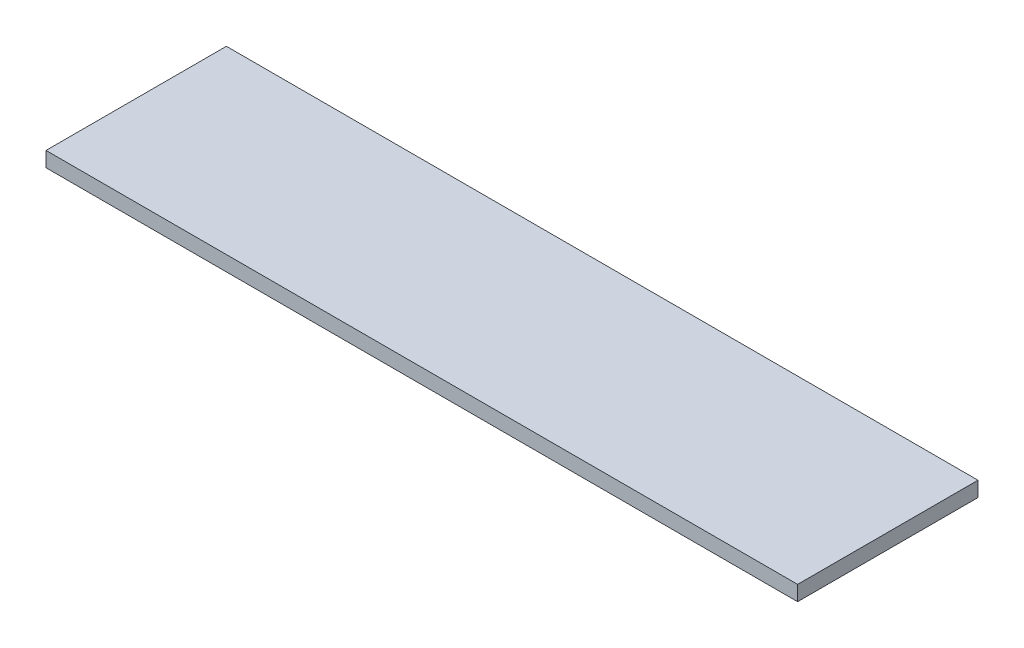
ISO-10303-21;
HEADER;
FILE_DESCRIPTION(('STEP AP214'),'2;1');
FILE_NAME('part.step','',(''),(''),'','','');
FILE_SCHEMA(('AUTOMOTIVE_DESIGN { 1 0 10303 214 1 1 1 1 }'));
ENDSEC;
DATA;
#1=APPLICATION_CONTEXT('core data for automotive mechanical design processes');
#2=APPLICATION_PROTOCOL_DEFINITION('international standard','automotive_design',2000,#1);
#3=PRODUCT_CONTEXT('',#1,'mechanical');
#4=PRODUCT('Part','Part','',(#3));
#5=PRODUCT_RELATED_PRODUCT_CATEGORY('part','',(#4));
#6=PRODUCT_DEFINITION_FORMATION('','',#4);
#7=PRODUCT_DEFINITION_CONTEXT('part definition',#1,'design');
#8=PRODUCT_DEFINITION('design','',#6,#7);
#9=PRODUCT_DEFINITION_SHAPE('','',#8);
#10=(LENGTH_UNIT() NAMED_UNIT(*) SI_UNIT(.MILLI.,.METRE.));
#11=(NAMED_UNIT(*) PLANE_ANGLE_UNIT() SI_UNIT($,.RADIAN.));
#12=(NAMED_UNIT(*) SI_UNIT($,.STERADIAN.) SOLID_ANGLE_UNIT());
#13=UNCERTAINTY_MEASURE_WITH_UNIT(LENGTH_MEASURE(1.E-05),#10,'distance_accuracy_value','');
#14=(GEOMETRIC_REPRESENTATION_CONTEXT(3) GLOBAL_UNCERTAINTY_ASSIGNED_CONTEXT((#13)) GLOBAL_UNIT_ASSIGNED_CONTEXT((#10,
#11,#12)) REPRESENTATION_CONTEXT('',''));
#15=CARTESIAN_POINT('',(0.,0.,0.));
#16=DIRECTION('',(0.,0.,1.));
#17=DIRECTION('',(1.,0.,0.));
#18=AXIS2_PLACEMENT_3D('',#15,#16,#17);
#19=CARTESIAN_POINT('',(0.,0.,609.6));
#20=DIRECTION('',(1.,0.,0.));
#21=DIRECTION('',(0.,0.,-1.));
#22=AXIS2_PLACEMENT_3D('',#19,#20,#21);
#23=PLANE('',#22);
#24=DIRECTION('',(0.,0.,-1.));
#25=VECTOR('',#24,1.);
#26=CARTESIAN_POINT('',(0.,0.,609.6));
#27=LINE('',#26,#25);
#28=CARTESIAN_POINT('',(0.,0.,533.4));
#29=VERTEX_POINT('',#28);
#30=CARTESIAN_POINT('',(0.,0.,0.));
#31=VERTEX_POINT('',#30);
#32=EDGE_CURVE('E11',#29,#31,#27,.T.);
#33=ORIENTED_EDGE('',*,*,#32,.F.);
#34=DIRECTION('',(0.,-1.,0.));
#35=VECTOR('',#34,1.);
#36=CARTESIAN_POINT('',(0.,50.8,533.4));
#37=LINE('',#36,#35);
#38=CARTESIAN_POINT('',(0.,50.8,533.4));
#39=VERTEX_POINT('',#38);
#40=EDGE_CURVE('E109',#39,#29,#37,.T.);
#41=ORIENTED_EDGE('',*,*,#40,.F.);
#42=DIRECTION('',(0.,0.,-1.));
#43=VECTOR('',#42,1.);
#44=CARTESIAN_POINT('',(0.,50.8,609.6));
#45=LINE('',#44,#43);
#46=CARTESIAN_POINT('',(0.,50.8,0.));
#47=VERTEX_POINT('',#46);
#48=EDGE_CURVE('E85',#39,#47,#45,.T.);
#49=ORIENTED_EDGE('',*,*,#48,.T.);
#50=DIRECTION('',(0.,-1.,0.));
#51=VECTOR('',#50,1.);
#52=CARTESIAN_POINT('',(0.,0.,0.));
#53=LINE('',#52,#51);
#54=EDGE_CURVE('E151',#47,#31,#53,.T.);
#55=ORIENTED_EDGE('',*,*,#54,.T.);
#56=EDGE_LOOP('',(#33,#41,#49,#55));
#57=FACE_BOUND('',#56,.T.);
#58=ADVANCED_FACE('F32',(#57),#23,.F.);
#59=CARTESIAN_POINT('',(0.,0.,609.6));
#60=DIRECTION('',(0.,1.,0.));
#61=DIRECTION('',(0.,0.,1.));
#62=AXIS2_PLACEMENT_3D('',#59,#60,#61);
#63=PLANE('',#62);
#64=DIRECTION('',(0.,0.,-1.));
#65=VECTOR('',#64,1.);
#66=CARTESIAN_POINT('',(2438.4,1.33226762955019E-12,609.6));
#67=LINE('',#66,#65);
#68=CARTESIAN_POINT('',(2438.4,1.33226762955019E-12,533.4));
#69=VERTEX_POINT('',#68);
#70=CARTESIAN_POINT('',(2438.4,1.33226762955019E-12,0.));
#71=VERTEX_POINT('',#70);
#72=EDGE_CURVE('E40',#69,#71,#67,.T.);
#73=ORIENTED_EDGE('',*,*,#72,.F.);
#74=DIRECTION('',(1.,0.,0.));
#75=VECTOR('',#74,1.);
#76=CARTESIAN_POINT('',(-50.8009999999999,0.,533.4));
#77=LINE('',#76,#75);
#78=EDGE_CURVE('E104',#29,#69,#77,.T.);
#79=ORIENTED_EDGE('',*,*,#78,.F.);
#80=ORIENTED_EDGE('',*,*,#32,.T.);
#81=DIRECTION('',(1.,0.,0.));
#82=VECTOR('',#81,1.);
#83=CARTESIAN_POINT('',(0.,0.,0.));
#84=LINE('',#83,#82);
#85=EDGE_CURVE('E123',#31,#71,#84,.T.);
#86=ORIENTED_EDGE('',*,*,#85,.T.);
#87=EDGE_LOOP('',(#73,#79,#80,#86));
#88=FACE_BOUND('',#87,.T.);
#89=ADVANCED_FACE('F121',(#88),#63,.F.);
#90=CARTESIAN_POINT('',(2438.4,1.33226762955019E-12,609.6));
#91=DIRECTION('',(-1.,0.,0.));
#92=DIRECTION('',(0.,0.,1.));
#93=AXIS2_PLACEMENT_3D('',#90,#91,#92);
#94=PLANE('',#93);
#95=DIRECTION('',(0.,0.,-1.));
#96=VECTOR('',#95,1.);
#97=CARTESIAN_POINT('',(2438.4,50.8000000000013,609.6));
#98=LINE('',#97,#96);
#99=CARTESIAN_POINT('',(2438.4,50.8000000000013,533.4));
#100=VERTEX_POINT('',#99);
#101=CARTESIAN_POINT('',(2438.4,50.8000000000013,0.));
#102=VERTEX_POINT('',#101);
#103=EDGE_CURVE('E119',#100,#102,#98,.T.);
#104=ORIENTED_EDGE('',*,*,#103,.F.);
#105=DIRECTION('',(0.,1.,0.));
#106=VECTOR('',#105,1.);
#107=CARTESIAN_POINT('',(2438.4,50.8000000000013,533.4));
#108=LINE('',#107,#106);
#109=EDGE_CURVE('E107',#69,#100,#108,.T.);
#110=ORIENTED_EDGE('',*,*,#109,.F.);
#111=ORIENTED_EDGE('',*,*,#72,.T.);
#112=DIRECTION('',(0.,1.,0.));
#113=VECTOR('',#112,1.);
#114=CARTESIAN_POINT('',(2438.4,1.33226762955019E-12,0.));
#115=LINE('',#114,#113);
#116=EDGE_CURVE('E148',#71,#102,#115,.T.);
#117=ORIENTED_EDGE('',*,*,#116,.T.);
#118=EDGE_LOOP('',(#104,#110,#111,#117));
#119=FACE_BOUND('',#118,.T.);
#120=ADVANCED_FACE('F116',(#119),#94,.F.);
#121=CARTESIAN_POINT('',(2489.2,50.8000000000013,609.6));
#122=DIRECTION('',(-1.,0.,0.));
#123=DIRECTION('',(0.,0.,1.));
#124=AXIS2_PLACEMENT_3D('',#121,#122,#123);
#125=PLANE('',#124);
#126=DIRECTION('',(0.,1.,0.));
#127=VECTOR('',#126,1.);
#128=CARTESIAN_POINT('',(2489.2,50.8000000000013,0.));
#129=LINE('',#128,#127);
#130=CARTESIAN_POINT('',(2489.2,50.8000000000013,0.));
#131=VERTEX_POINT('',#130);
#132=CARTESIAN_POINT('',(2489.2,101.600000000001,0.));
#133=VERTEX_POINT('',#132);
#134=EDGE_CURVE('E144',#131,#133,#129,.T.);
#135=ORIENTED_EDGE('',*,*,#134,.T.);
#136=DIRECTION('',(0.,0.,-1.));
#137=VECTOR('',#136,1.);
#138=CARTESIAN_POINT('',(2489.2,101.600000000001,609.6));
#139=LINE('',#138,#137);
#140=CARTESIAN_POINT('',(2489.2,101.600000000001,609.6));
#141=VERTEX_POINT('',#140);
#142=EDGE_CURVE('E130',#141,#133,#139,.T.);
#143=ORIENTED_EDGE('',*,*,#142,.F.);
#144=DIRECTION('',(0.,1.,0.));
#145=VECTOR('',#144,1.);
#146=CARTESIAN_POINT('',(2489.2,50.8000000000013,609.6));
#147=LINE('',#146,#145);
#148=CARTESIAN_POINT('',(2489.2,50.8000000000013,609.6));
#149=VERTEX_POINT('',#148);
#150=EDGE_CURVE('E156',#149,#141,#147,.T.);
#151=ORIENTED_EDGE('',*,*,#150,.F.);
#152=DIRECTION('',(0.,0.,-1.));
#153=VECTOR('',#152,1.);
#154=CARTESIAN_POINT('',(2489.2,50.8000000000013,609.6));
#155=LINE('',#154,#153);
#156=EDGE_CURVE('E125',#149,#131,#155,.T.);
#157=ORIENTED_EDGE('',*,*,#156,.T.);
#158=EDGE_LOOP('',(#135,#143,#151,#157));
#159=FACE_BOUND('',#158,.T.);
#160=ADVANCED_FACE('F170',(#159),#125,.F.);
#161=CARTESIAN_POINT('',(2489.2,101.600000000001,609.6));
#162=DIRECTION('',(0.,-1.,0.));
#163=DIRECTION('',(1.,0.,0.));
#164=AXIS2_PLACEMENT_3D('',#161,#162,#163);
#165=PLANE('',#164);
#166=DIRECTION('',(-1.,0.,0.));
#167=VECTOR('',#166,1.);
#168=CARTESIAN_POINT('',(2489.2,101.600000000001,0.));
#169=LINE('',#168,#167);
#170=CARTESIAN_POINT('',(-50.7999999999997,101.6,0.));
#171=VERTEX_POINT('',#170);
#172=EDGE_CURVE('E142',#133,#171,#169,.T.);
#173=ORIENTED_EDGE('',*,*,#172,.T.);
#174=DIRECTION('',(0.,0.,-1.));
#175=VECTOR('',#174,1.);
#176=CARTESIAN_POINT('',(-50.7999999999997,101.6,609.6));
#177=LINE('',#176,#175);
#178=CARTESIAN_POINT('',(-50.7999999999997,101.6,609.6));
#179=VERTEX_POINT('',#178);
#180=EDGE_CURVE('E133',#179,#171,#177,.T.);
#181=ORIENTED_EDGE('',*,*,#180,.F.);
#182=DIRECTION('',(-1.,0.,0.));
#183=VECTOR('',#182,1.);
#184=CARTESIAN_POINT('',(2489.2,101.600000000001,609.6));
#185=LINE('',#184,#183);
#186=EDGE_CURVE('E154',#141,#179,#185,.T.);
#187=ORIENTED_EDGE('',*,*,#186,.F.);
#188=ORIENTED_EDGE('',*,*,#142,.T.);
#189=EDGE_LOOP('',(#173,#181,#187,#188));
#190=FACE_BOUND('',#189,.T.);
#191=ADVANCED_FACE('F177',(#190),#165,.F.);
#192=CARTESIAN_POINT('',(-50.7999999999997,101.6,609.6));
#193=DIRECTION('',(1.,0.,0.));
#194=DIRECTION('',(0.,1.,0.));
#195=AXIS2_PLACEMENT_3D('',#192,#193,#194);
#196=PLANE('',#195);
#197=DIRECTION('',(0.,-1.,0.));
#198=VECTOR('',#197,1.);
#199=CARTESIAN_POINT('',(-50.7999999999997,101.6,0.));
#200=LINE('',#199,#198);
#201=CARTESIAN_POINT('',(-50.7999999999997,50.8,0.));
#202=VERTEX_POINT('',#201);
#203=EDGE_CURVE('E78',#171,#202,#200,.T.);
#204=ORIENTED_EDGE('',*,*,#203,.T.);
#205=DIRECTION('',(0.,0.,-1.));
#206=VECTOR('',#205,1.);
#207=CARTESIAN_POINT('',(-50.7999999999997,50.8,609.6));
#208=LINE('',#207,#206);
#209=CARTESIAN_POINT('',(-50.7999999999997,50.8,609.6));
#210=VERTEX_POINT('',#209);
#211=EDGE_CURVE('E135',#210,#202,#208,.T.);
#212=ORIENTED_EDGE('',*,*,#211,.F.);
#213=DIRECTION('',(0.,-1.,0.));
#214=VECTOR('',#213,1.);
#215=CARTESIAN_POINT('',(-50.7999999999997,101.6,609.6));
#216=LINE('',#215,#214);
#217=EDGE_CURVE('E138',#179,#210,#216,.T.);
#218=ORIENTED_EDGE('',*,*,#217,.F.);
#219=ORIENTED_EDGE('',*,*,#180,.T.);
#220=EDGE_LOOP('',(#204,#212,#218,#219));
#221=FACE_BOUND('',#220,.T.);
#222=ADVANCED_FACE('F178',(#221),#196,.F.);
#223=CARTESIAN_POINT('',(-50.7999999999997,50.8,609.6));
#224=DIRECTION('',(0.,1.,0.));
#225=DIRECTION('',(0.,0.,1.));
#226=AXIS2_PLACEMENT_3D('',#223,#224,#225);
#227=PLANE('',#226);
#228=DIRECTION('',(1.,0.,0.));
#229=VECTOR('',#228,1.);
#230=CARTESIAN_POINT('',(-50.7999999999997,50.8,0.));
#231=LINE('',#230,#229);
#232=EDGE_CURVE('E139',#202,#47,#231,.T.);
#233=ORIENTED_EDGE('',*,*,#232,.T.);
#234=ORIENTED_EDGE('',*,*,#48,.F.);
#235=DIRECTION('',(1.,0.,0.));
#236=VECTOR('',#235,1.);
#237=CARTESIAN_POINT('',(-50.8009999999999,50.8,533.4));
#238=LINE('',#237,#236);
#239=EDGE_CURVE('E113',#39,#100,#238,.T.);
#240=ORIENTED_EDGE('',*,*,#239,.T.);
#241=ORIENTED_EDGE('',*,*,#103,.T.);
#242=DIRECTION('',(1.,0.,0.));
#243=VECTOR('',#242,1.);
#244=CARTESIAN_POINT('',(2438.4,50.8000000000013,0.));
#245=LINE('',#244,#243);
#246=EDGE_CURVE('E146',#102,#131,#245,.T.);
#247=ORIENTED_EDGE('',*,*,#246,.T.);
#248=ORIENTED_EDGE('',*,*,#156,.F.);
#249=DIRECTION('',(1.,0.,0.));
#250=VECTOR('',#249,1.);
#251=CARTESIAN_POINT('',(2438.4,50.8000000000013,609.6));
#252=LINE('',#251,#250);
#253=EDGE_CURVE('E48',#210,#149,#252,.T.);
#254=ORIENTED_EDGE('',*,*,#253,.F.);
#255=ORIENTED_EDGE('',*,*,#211,.T.);
#256=EDGE_LOOP('',(#233,#234,#240,#241,#247,#248,#254,#255));
#257=FACE_BOUND('',#256,.T.);
#258=ADVANCED_FACE('F160',(#257),#227,.F.);
#259=CARTESIAN_POINT('',(0.,0.,609.6));
#260=DIRECTION('',(0.,0.,-1.));
#261=DIRECTION('',(-1.,0.,0.));
#262=AXIS2_PLACEMENT_3D('',#259,#260,#261);
#263=PLANE('',#262);
#264=ORIENTED_EDGE('',*,*,#217,.T.);
#265=ORIENTED_EDGE('',*,*,#253,.T.);
#266=ORIENTED_EDGE('',*,*,#150,.T.);
#267=ORIENTED_EDGE('',*,*,#186,.T.);
#268=EDGE_LOOP('',(#264,#265,#266,#267));
#269=FACE_BOUND('',#268,.T.);
#270=ADVANCED_FACE('F173',(#269),#263,.F.);
#271=CARTESIAN_POINT('',(0.,0.,0.));
#272=DIRECTION('',(0.,0.,-1.));
#273=DIRECTION('',(-1.,0.,0.));
#274=AXIS2_PLACEMENT_3D('',#271,#272,#273);
#275=PLANE('',#274);
#276=ORIENTED_EDGE('',*,*,#54,.F.);
#277=ORIENTED_EDGE('',*,*,#232,.F.);
#278=ORIENTED_EDGE('',*,*,#203,.F.);
#279=ORIENTED_EDGE('',*,*,#172,.F.);
#280=ORIENTED_EDGE('',*,*,#134,.F.);
#281=ORIENTED_EDGE('',*,*,#246,.F.);
#282=ORIENTED_EDGE('',*,*,#116,.F.);
#283=ORIENTED_EDGE('',*,*,#85,.F.);
#284=EDGE_LOOP('',(#276,#277,#278,#279,#280,#281,#282,#283));
#285=FACE_BOUND('',#284,.T.);
#286=ADVANCED_FACE('F163',(#285),#275,.T.);
#287=CARTESIAN_POINT('',(-50.8009999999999,50.8,533.4));
#288=DIRECTION('',(0.,0.,-1.));
#289=DIRECTION('',(-1.,0.,0.));
#290=AXIS2_PLACEMENT_3D('',#287,#288,#289);
#291=PLANE('',#290);
#292=ORIENTED_EDGE('',*,*,#40,.T.);
#293=ORIENTED_EDGE('',*,*,#78,.T.);
#294=ORIENTED_EDGE('',*,*,#109,.T.);
#295=ORIENTED_EDGE('',*,*,#239,.F.);
#296=EDGE_LOOP('',(#292,#293,#294,#295));
#297=FACE_BOUND('',#296,.T.);
#298=ADVANCED_FACE('F106',(#297),#291,.F.);
#299=CLOSED_SHELL('',(#58,#89,#120,#160,#191,#222,#258,#270,#286,#298));
#300=MANIFOLD_SOLID_BREP('B2',#299);
#301=ADVANCED_BREP_SHAPE_REPRESENTATION('',(#18,#300),#14);
#302=SHAPE_DEFINITION_REPRESENTATION(#9,#301);
ENDSEC;
END-ISO-10303-21;
